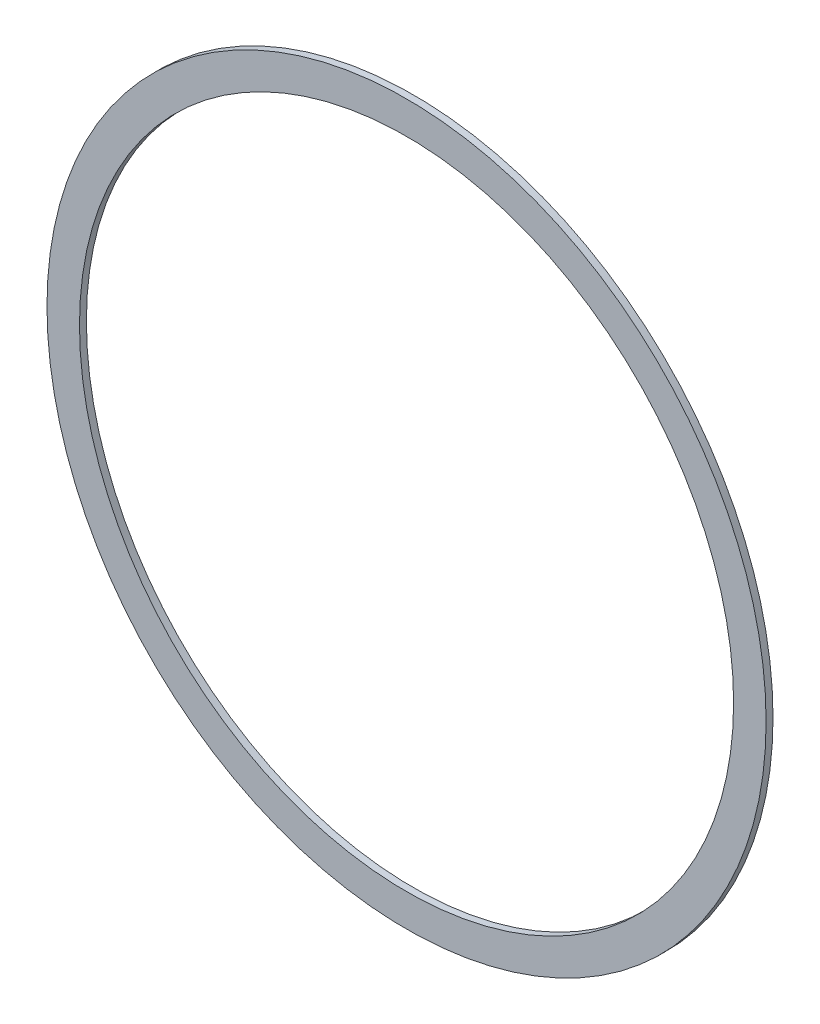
from build123d import *

# Parameters (mm, degrees)
ESQUISSE1_R          = 26
ESQUISSE1_R_2        = 23.65
BASE_EXTRUSION_DEPTH = 0.5


with BuildPart() as part:
    # Esquisse1 → Base-Extrusion (new body)
    with BuildSketch(Plane.XY):
        with Locations((0, 24.777112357)):
            Circle(ESQUISSE1_R)
        with Locations((0, 24.777112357)):
            Circle(ESQUISSE1_R_2, mode=Mode.SUBTRACT)
    extrude(amount=BASE_EXTRUSION_DEPTH)


solid = part.part
